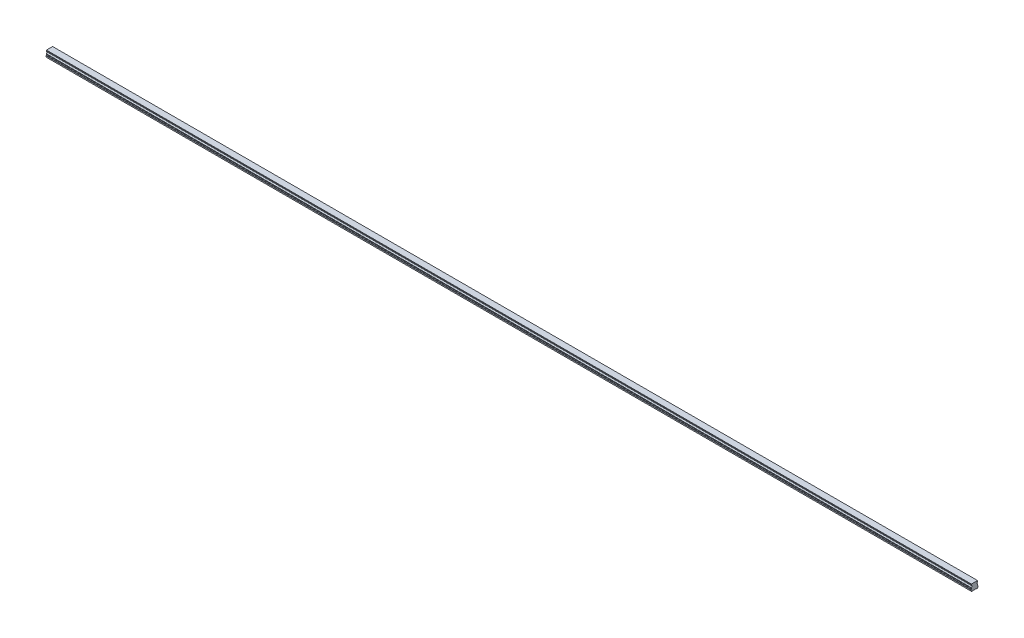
from build123d import *

# Parameters (mm, degrees)
BOSS_EXTRUDE1_DEPTH        = 1980
SKETCH3_R                  = 2.5
SKETCH3_R_2                = 2.1
CUT_EXTRUDE3_DEPTH         = 7
SKETCH3_2_R                = 2.1
CUT_EXTRUDE4_DEPTH         = 9.5
CHAMFER1_SIZE              = 0.4
LPATTERN2_COUNT            = 33
LPATTERN2_PITCH            = 60
CHAMFER1_OF_LPATTERN2_SIZE = 0.4


with BuildPart() as part:
    # Sketch1 → Boss-Extrude1 (new body)
    with BuildSketch(Plane(origin=(0, 0, 0), x_dir=(0, 0, -1), z_dir=(1, 0, 0))):
        with BuildLine():
            Line((6.59, 14), (-6.59, 14))
            Line((-6.59, 14), (-6.59, 13.15))
            Line((-6.59, 13.15), (-6.96, 12.356532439))
            Line((-6.96, 12.356532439), (-6.96, 11.435174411))
            ThreePointArc((-6.96, 11.435174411), (-5.25, 9.5), (-6.96, 7.564825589))
            Line((-6.96, 7.564825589), (-6.96, 6.643467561))
            Line((-6.96, 6.643467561), (-6.59, 5.85))
            Line((-6.59, 5.85), (-7.032116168, 4.2))
            Line((-7.032116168, 4.2), (-7.5, 3.929867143))
            Line((-7.5, 3.929867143), (-7.5, 1.4))
            Line((-7.5, 1.4), (-6.1, 0))
            Line((-6.1, 0), (-3.65, 0))
            Line((-3.65, 0), (-3.25, 0.4))
            Line((-3.25, 0.4), (3.25, 0.4))
            Line((3.25, 0.4), (3.65, 0))
            Line((3.65, 0), (6.1, 0))
            Line((6.1, 0), (7.5, 1.4))
            Line((7.5, 1.4), (7.5, 3.929867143))
            Line((7.5, 3.929867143), (7.032116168, 4.2))
            Line((7.032116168, 4.2), (6.59, 5.85))
            Line((6.59, 5.85), (6.96, 6.643467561))
            Line((6.96, 6.643467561), (6.96, 7.564825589))
            ThreePointArc((6.96, 7.564825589), (5.25, 9.5), (6.96, 11.435174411))
            Line((6.96, 11.435174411), (6.96, 12.356532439))
            Line((6.96, 12.356532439), (6.59, 13.15))
            Line((6.59, 13.15), (6.59, 14))
        make_face()
    extrude(amount=BOSS_EXTRUDE1_DEPTH)

    # Sketch3 → Cut-Extrude3 (cut)
    with BuildSketch(Plane.XZ):
        with Locations(Location((30, 0, 0), (0, 0, 270))):
            Circle(SKETCH3_R)
        with Locations(Location((30, 0, 0), (0, 0, 270))):
            Circle(SKETCH3_R_2, mode=Mode.SUBTRACT)
    cut_extrude3 = extrude(amount=-CUT_EXTRUDE3_DEPTH, mode=Mode.SUBTRACT)

    # Sketch3_2 → Cut-Extrude4 (cut)
    with BuildSketch(Plane.XZ):
        with Locations(Location((30, 0, 0), (0, 0, 270))):
            Circle(SKETCH3_2_R)
    cut_extrude4 = extrude(amount=-CUT_EXTRUDE4_DEPTH, mode=Mode.SUBTRACT)

    # Cut-Extrude5 cone 1 section (on through the dimple's axis) → Cut-Extrude5 (revolve, cut)
    with BuildSketch(Plane(origin=(30, 9.5, 0), x_dir=(0, 0, -1), z_dir=(1, 0, 0))):
        Polygon((0, 0), (2.1, 0), (0, 1.212435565), align=None)
    revolve(axis=Axis((30, 9.5, 0), (0, 1, 0)), mode=Mode.SUBTRACT)

    # Chamfer1
    chamfer1_edges = [part.edges().sort_by_distance(p)[0] for p in [
        (30, 0.4, 2.5),
    ]]
    chamfer(chamfer1_edges, length=CHAMFER1_SIZE)

    # LPattern2: Cut-Extrude3, Cut-Extrude4 ×33
    with Locations(*[(i * LPATTERN2_PITCH, 0, 0) for i in range(1, LPATTERN2_COUNT)]):
        add(cut_extrude3, mode=Mode.SUBTRACT)
        add(cut_extrude4, mode=Mode.SUBTRACT)

    # Chamfer1 of LPattern2
    chamfer1_of_lpattern2_edges = [part.edges().sort_by_distance(p)[0] for p in [
        (90, 0.4, 2.5),
        (150, 0.4, 2.5),
        (210, 0.4, 2.5),
        (270, 0.4, 2.5),
        (330, 0.4, 2.5),
        (390, 0.4, 2.5),
        (450, 0.4, 2.5),
        (510, 0.4, 2.5),
        (570, 0.4, 2.5),
        (630, 0.4, 2.5),
        (690, 0.4, 2.5),
        (750, 0.4, 2.5),
        (810, 0.4, 2.5),
        (870, 0.4, 2.5),
        (930, 0.4, 2.5),
        (990, 0.4, 2.5),
        (1050, 0.4, 2.5),
        (1110, 0.4, 2.5),
        (1170, 0.4, 2.5),
        (1230, 0.4, 2.5),
        (1290, 0.4, 2.5),
        (1350, 0.4, 2.5),
        (1410, 0.4, 2.5),
        (1470, 0.4, 2.5),
        (1530, 0.4, 2.5),
        (1590, 0.4, 2.5),
        (1650, 0.4, 2.5),
        (1710, 0.4, 2.5),
        (1770, 0.4, 2.5),
        (1830, 0.4, 2.5),
        (1890, 0.4, 2.5),
        (1950, 0.4, 2.5),
    ]]
    chamfer(chamfer1_of_lpattern2_edges, length=CHAMFER1_OF_LPATTERN2_SIZE)


solid = part.part
